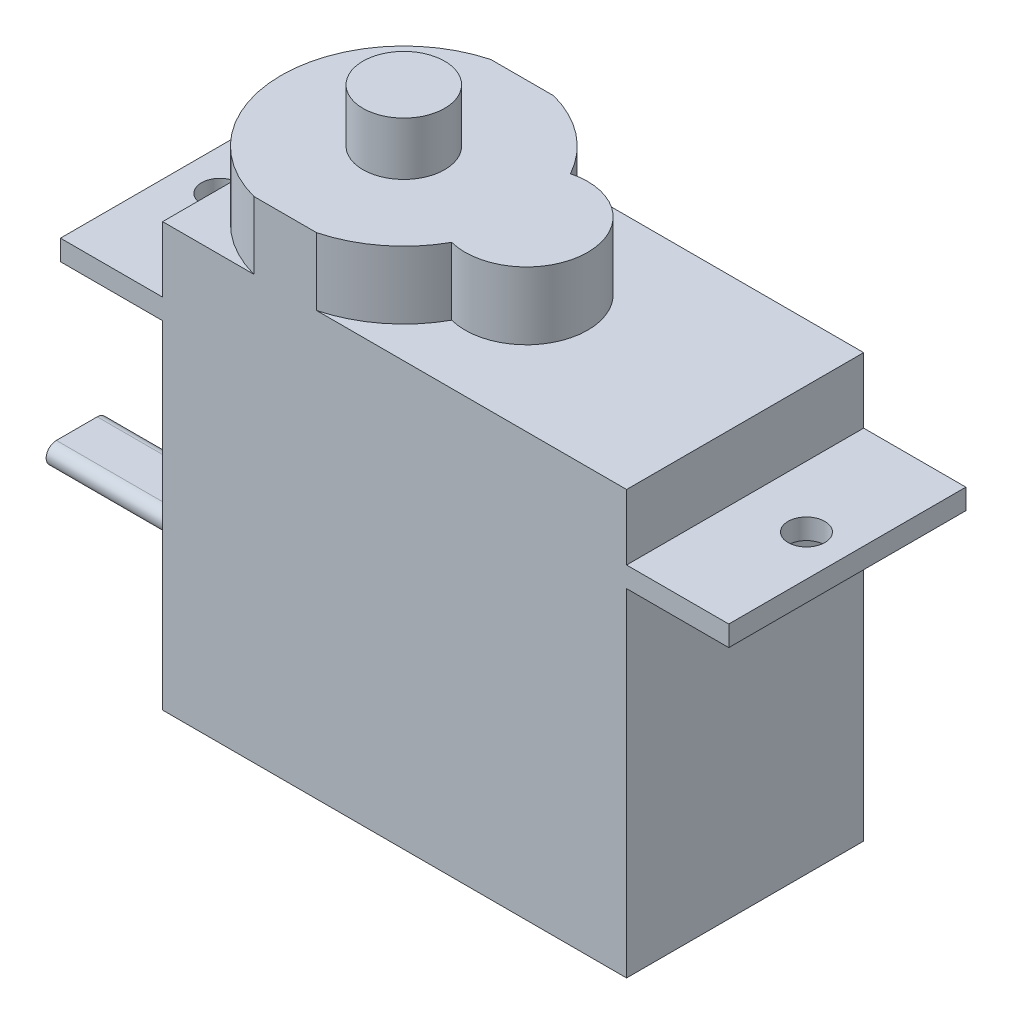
from build123d import *

# Parameters (mm, degrees)
EXTRUSION1_DEPTH        = 11.6
ESQUISSE2_R             = 0.9
ENL_V_MAT_EXTRU_1_DEPTH = 35.757732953
EXTRUSION2_DEPTH        = 3.3
ESQUISSE8_R             = 2
EXTRUSION7_DEPTH        = 2.6
EXTRUSION5_DEPTH        = 10


with BuildPart() as part:
    # Esquisse1 → Extrusion1 (new body)
    with BuildSketch(Plane.XY):
        Polygon((27.7, 17.5), (22.7, 17.5), (22.7, 20.7), (0, 20.7), (0, 17.5), (-5, 17.5), (-5, 16.5), (0, 16.5), (0, 0), (22.7, 0), (22.7, 16.5), (27.7, 16.5), align=None)
    extrude(amount=EXTRUSION1_DEPTH)

    # Esquisse2 → Enl_v. mat.-Extru.1 (cut, through all)
    with BuildSketch(Plane(origin=(0, 17.5, 0), x_dir=(1, 0, 0), z_dir=(0, 1, 0))):
        with Locations(Location((25.7, -5.8, 0), (0, 0, 270))):
            Circle(ESQUISSE2_R)
        with Locations(Location((-3, -5.8, 0), (0, 0, 270))):
            Circle(ESQUISSE2_R)
    extrude(amount=-ENL_V_MAT_EXTRU_1_DEPTH, mode=Mode.SUBTRACT)

    # Esquisse3 → Extrusion2 (add)
    with BuildSketch(Plane(origin=(0, 20.7, 0), x_dir=(1, 0, 0), z_dir=(0, 1, 0))):
        with BuildLine():
            Line((7.53622915, -11.6), (4.46377085, -11.6))
            ThreePointArc((4.46377085, -11.6), (0, -5.8), (4.46377085, 0))
            Line((4.46377085, 0), (7.53622915, 0))
            ThreePointArc((7.53622915, 0), (9.689019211, -1.068072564), (11.25, -2.89526249))
            ThreePointArc((11.25, -2.89526249), (15, -5.8), (11.25, -8.70473751))
            ThreePointArc((11.25, -8.70473751), (9.689019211, -10.531927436), (7.53622915, -11.6))
        make_face()
    extrude(amount=EXTRUSION2_DEPTH)

    # Esquisse8 → Extrusion7 (add)
    with BuildSketch(Plane(origin=(0, 24, 0), x_dir=(1, 0, 0), z_dir=(0, 1, 0))):
        with Locations(Location((6, -5.8, 0), (0, 0, 270))):
            Circle(ESQUISSE8_R)
    extrude(amount=EXTRUSION7_DEPTH)

    # Esquisse6 → Extrusion5 (add)
    with BuildSketch(Plane.ZY):
        with BuildLine():
            Line((4.8, 4.029625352), (6.8, 4.029625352))
            ThreePointArc((6.8, 4.029625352), (7.3, 3.529625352), (6.8, 3.029625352))
            Line((6.8, 3.029625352), (4.8, 3.029625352))
            ThreePointArc((4.8, 3.029625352), (4.3, 3.529625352), (4.8, 4.029625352))
        make_face()
    extrude(amount=EXTRUSION5_DEPTH)


solid = part.part
